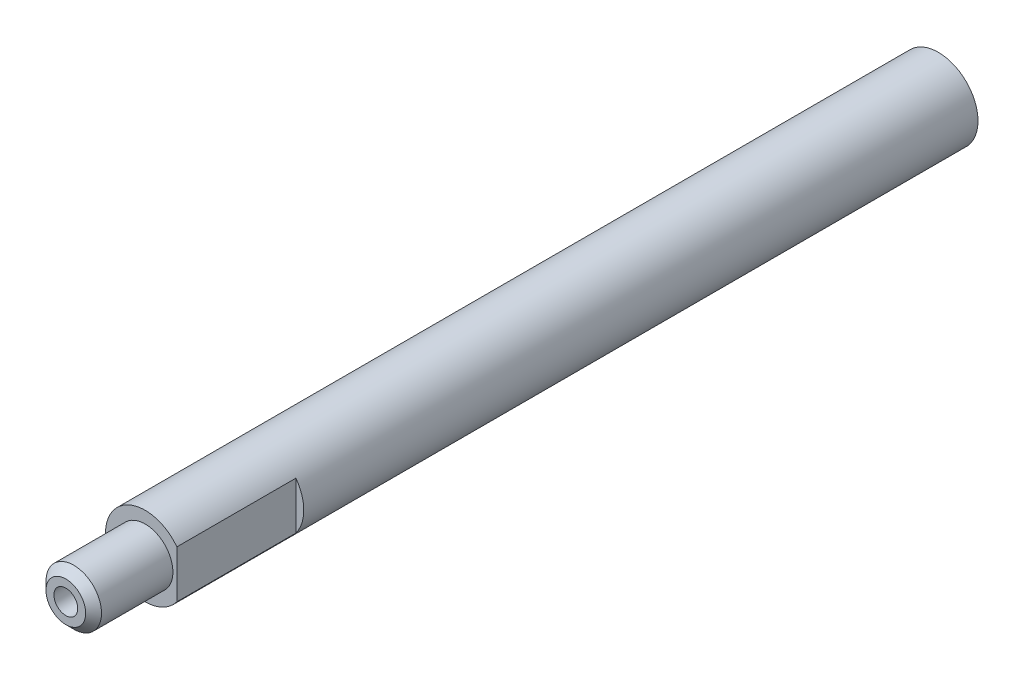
from build123d import *

# Parameters (mm, degrees)
SKETCH1_R                = 5
BASE_EXTRUDE_DEPTH       = 110
SKETCH6_OUTSIDE_W        = 34.182
SKETCH6_OUTSIDE_H        = 34.182
SKETCH6_OUTSIDE_R        = 3.5
FRONT_CUT_DEPTH          = 10
F_3_0_3_FRONT_HOLE_D     = 3
F_3_0_3_FRONT_HOLE_DEPTH = 10
F_3_0_3_FRONT_HOLE_TIP   = 0.901290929
CHAMFER1_SIZE            = 1
KEYWAY_START             = -15
KEYWAY_CUT_DEPTH         = 15
F_4_0_4_BACK_HOLE_D      = 4
F_4_0_4_BACK_HOLE_DEPTH  = 20
F_4_0_4_BACK_HOLE_TIP    = 1.201721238


with BuildPart() as part:
    # Sketch1 → Base Extrude (new body)
    with BuildSketch(Plane.XY):
        Circle(SKETCH1_R)
    extrude(amount=BASE_EXTRUDE_DEPTH)

    # Sketch6 outside → Front Cut (cut)
    with BuildSketch(Plane.XY.offset(110)):
        Rectangle(SKETCH6_OUTSIDE_W, SKETCH6_OUTSIDE_H)
        Circle(SKETCH6_OUTSIDE_R, mode=Mode.SUBTRACT)
    extrude(amount=-FRONT_CUT_DEPTH, mode=Mode.SUBTRACT)

    # 3.0 _3_ Front Hole
    with Locations(Plane.XY.offset(110)):
        with Locations((0, 0)):
            Hole(F_3_0_3_FRONT_HOLE_D / 2, depth=F_3_0_3_FRONT_HOLE_DEPTH)
            with Locations((0, 0, -(F_3_0_3_FRONT_HOLE_DEPTH + F_3_0_3_FRONT_HOLE_TIP / 2))):  # 118° drill point
                Cone(0, F_3_0_3_FRONT_HOLE_D / 2, F_3_0_3_FRONT_HOLE_TIP, mode=Mode.SUBTRACT)

    # Chamfer1
    chamfer1_edges = [part.edges().sort_by_distance(p)[0] for p in [
        (-3.5, 0, 110),
    ]]
    chamfer(chamfer1_edges, length=CHAMFER1_SIZE)

    # Keyway Sketch → Keyway Cut (cut)
    with BuildSketch(Plane.XY.offset(100).offset(KEYWAY_START)):
        with BuildLine():
            Line((4, 3), (4, -3))
            ThreePointArc((4, -3), (5, 0), (4, 3))
        make_face()
    extrude(amount=KEYWAY_CUT_DEPTH, mode=Mode.SUBTRACT)

    # 4.0 _4_ Back Hole
    with Locations(Plane(origin=(0, 0, 0), x_dir=(-1, 0, 0), z_dir=(0, 0, -1))):
        with Locations((0, 0)):
            Hole(F_4_0_4_BACK_HOLE_D / 2, depth=F_4_0_4_BACK_HOLE_DEPTH)
            with Locations((0, 0, -(F_4_0_4_BACK_HOLE_DEPTH + F_4_0_4_BACK_HOLE_TIP / 2))):  # 118° drill point
                Cone(0, F_4_0_4_BACK_HOLE_D / 2, F_4_0_4_BACK_HOLE_TIP, mode=Mode.SUBTRACT)


solid = part.part
